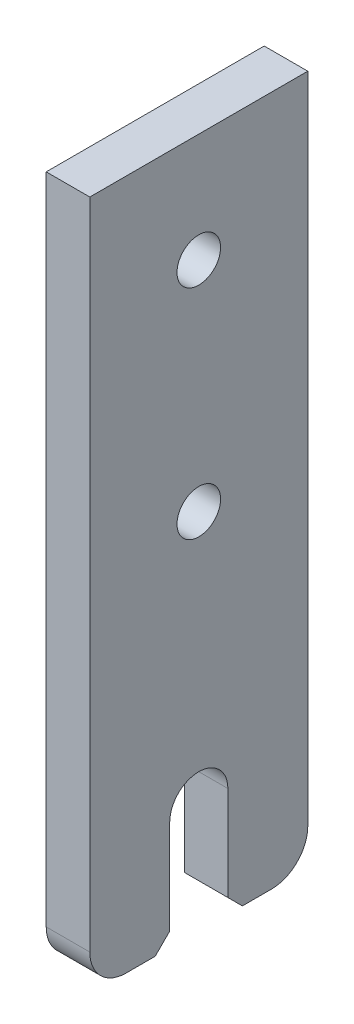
from build123d import *

# Parameters (mm, degrees)
CROQUIS1_W              = 30
CROQUIS1_H              = 95
SALIENTE_EXTRUIR1_DEPTH = 3
CORTAR_EXTRUIR1_DEPTH   = 51.17220346
CROQUIS3_R              = 3
CORTAR_EXTRUIR2_DEPTH   = 51.17220346
REDONDEO1_R             = 5
CHAFL_N1_SIZE           = 2


with BuildPart() as part:
    # Croquis1 → Saliente-Extruir1 (new, symmetric)
    with BuildSketch(Plane(origin=(0, 0, 0), x_dir=(0, 0, -1), z_dir=(1, 0, 0))):
        Rectangle(CROQUIS1_W, CROQUIS1_H)
    extrude(amount=SALIENTE_EXTRUIR1_DEPTH, both=True)

    # Croquis2 → Cortar-Extruir1 (cut, through all)
    with BuildSketch(Plane(origin=(3, 0, 0), x_dir=(0, 0, -1), z_dir=(1, 0, 0))):
        with BuildLine():
            Line((-4, -32.5), (-4, -47.5))
            Line((-4, -47.5), (4, -47.5))
            Line((4, -47.5), (4, -32.5))
            ThreePointArc((4, -32.5), (0, -28.5), (-4, -32.5))
        make_face()
    extrude(amount=-CORTAR_EXTRUIR1_DEPTH, mode=Mode.SUBTRACT)

    # Croquis3 → Cortar-Extruir2 (cut, through all)
    with BuildSketch(Plane(origin=(3, 0, 0), x_dir=(0, 0, -1), z_dir=(1, 0, 0))):
        with Locations((0, 32.5)):
            Circle(CROQUIS3_R)
        with Locations((0, 2.5)):
            Circle(CROQUIS3_R)
    extrude(amount=-CORTAR_EXTRUIR2_DEPTH, mode=Mode.SUBTRACT)

    # Redondeo1
    redondeo1_edges = [part.edges().sort_by_distance(p)[0] for p in [
        (0, -47.5, -15),
        (0, -47.5, 15),
    ]]
    fillet(redondeo1_edges, radius=REDONDEO1_R)

    # Chafl_n1
    chafl_n1_edges = [part.edges().sort_by_distance(p)[0] for p in [
        (0, -47.5, -4),
        (0, -47.5, 4),
    ]]
    chamfer(chafl_n1_edges, length=CHAFL_N1_SIZE)


solid = part.part
